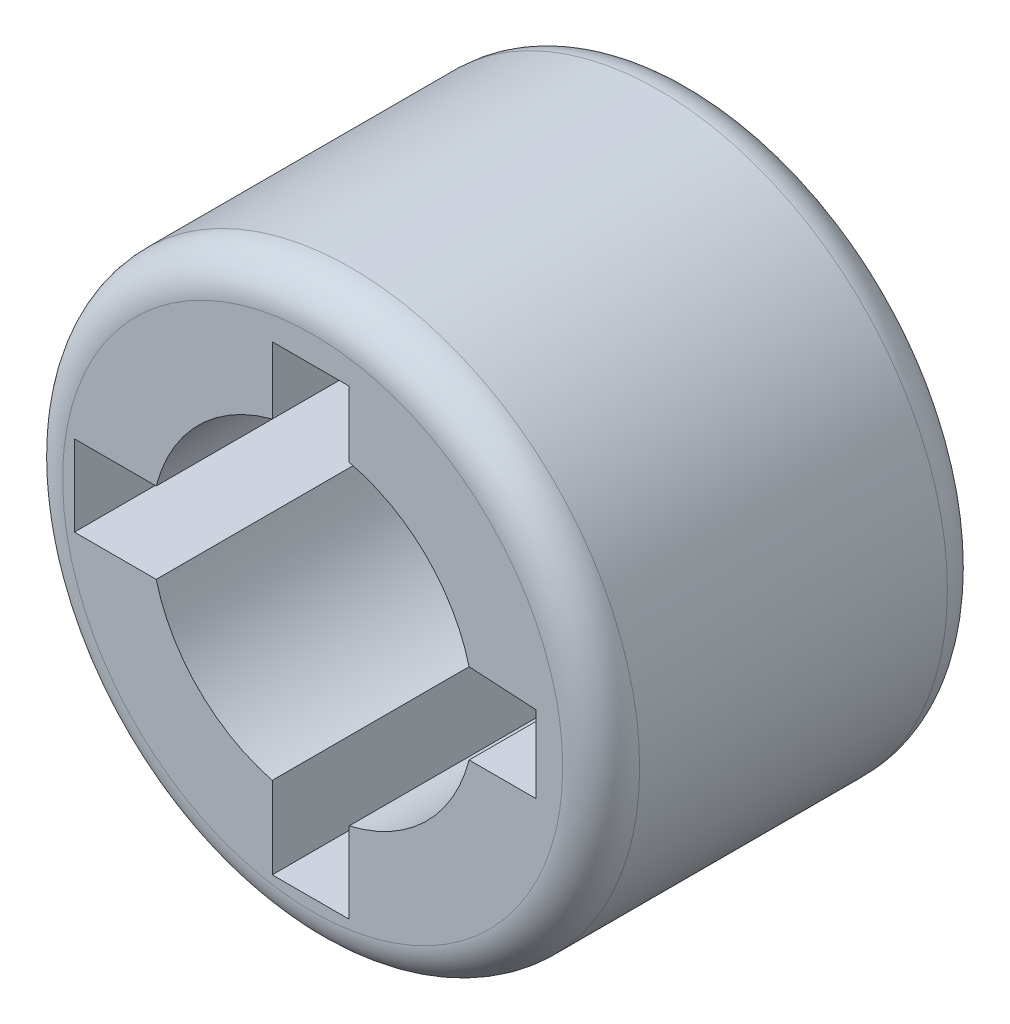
ISO-10303-21;
HEADER;
FILE_DESCRIPTION(('STEP AP214'),'2;1');
FILE_NAME('part.step','',(''),(''),'','','');
FILE_SCHEMA(('AUTOMOTIVE_DESIGN { 1 0 10303 214 1 1 1 1 }'));
ENDSEC;
DATA;
#1=APPLICATION_CONTEXT('core data for automotive mechanical design processes');
#2=APPLICATION_PROTOCOL_DEFINITION('international standard','automotive_design',2000,#1);
#3=PRODUCT_CONTEXT('',#1,'mechanical');
#4=PRODUCT('Part','Part','',(#3));
#5=PRODUCT_RELATED_PRODUCT_CATEGORY('part','',(#4));
#6=PRODUCT_DEFINITION_FORMATION('','',#4);
#7=PRODUCT_DEFINITION_CONTEXT('part definition',#1,'design');
#8=PRODUCT_DEFINITION('design','',#6,#7);
#9=PRODUCT_DEFINITION_SHAPE('','',#8);
#10=(LENGTH_UNIT() NAMED_UNIT(*) SI_UNIT(.MILLI.,.METRE.));
#11=(NAMED_UNIT(*) PLANE_ANGLE_UNIT() SI_UNIT($,.RADIAN.));
#12=(NAMED_UNIT(*) SI_UNIT($,.STERADIAN.) SOLID_ANGLE_UNIT());
#13=UNCERTAINTY_MEASURE_WITH_UNIT(LENGTH_MEASURE(1.E-05),#10,'distance_accuracy_value','');
#14=(GEOMETRIC_REPRESENTATION_CONTEXT(3) GLOBAL_UNCERTAINTY_ASSIGNED_CONTEXT((#13)) GLOBAL_UNIT_ASSIGNED_CONTEXT((#10,
#11,#12)) REPRESENTATION_CONTEXT('',''));
#15=CARTESIAN_POINT('',(0.,0.,0.));
#16=DIRECTION('',(0.,0.,1.));
#17=DIRECTION('',(1.,0.,0.));
#18=AXIS2_PLACEMENT_3D('',#15,#16,#17);
#19=CARTESIAN_POINT('',(0.,0.,10.));
#20=DIRECTION('',(0.,0.,1.));
#21=DIRECTION('',(1.,0.,0.));
#22=AXIS2_PLACEMENT_3D('',#19,#20,#21);
#23=PLANE('',#22);
#24=CARTESIAN_POINT('',(0.,0.,10.));
#25=DIRECTION('',(0.,0.,1.));
#26=DIRECTION('',(1.,0.,0.));
#27=AXIS2_PLACEMENT_3D('',#24,#25,#26);
#28=CIRCLE('',#27,6.5);
#29=CARTESIAN_POINT('',(6.5,0.,10.));
#30=VERTEX_POINT('',#29);
#31=EDGE_CURVE('E11',#30,#30,#28,.T.);
#32=ORIENTED_EDGE('',*,*,#31,.T.);
#33=EDGE_LOOP('',(#32));
#34=FACE_BOUND('',#33,.T.);
#35=CARTESIAN_POINT('',(0.,0.,10.));
#36=DIRECTION('',(0.,0.,1.));
#37=DIRECTION('',(1.,0.,0.));
#38=AXIS2_PLACEMENT_3D('',#35,#36,#37);
#39=CIRCLE('',#38,4.2);
#40=CARTESIAN_POINT('',(4.06663251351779,1.05,10.));
#41=VERTEX_POINT('',#40);
#42=CARTESIAN_POINT('',(0.95,4.09114898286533,10.));
#43=VERTEX_POINT('',#42);
#44=EDGE_CURVE('E154',#41,#43,#39,.T.);
#45=ORIENTED_EDGE('',*,*,#44,.F.);
#46=DIRECTION('',(-0.998352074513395,0.0573858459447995,0.));
#47=VECTOR('',#46,1.);
#48=CARTESIAN_POINT('',(4.06663251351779,1.05,10.));
#49=LINE('',#48,#47);
#50=CARTESIAN_POINT('',(5.80635083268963,0.95,10.));
#51=VERTEX_POINT('',#50);
#52=EDGE_CURVE('E146',#51,#41,#49,.T.);
#53=ORIENTED_EDGE('',*,*,#52,.F.);
#54=DIRECTION('',(0.,1.,0.));
#55=VECTOR('',#54,1.);
#56=CARTESIAN_POINT('',(5.80635083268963,-1.05,10.));
#57=LINE('',#56,#55);
#58=CARTESIAN_POINT('',(5.80635083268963,-1.05,10.));
#59=VERTEX_POINT('',#58);
#60=EDGE_CURVE('E195',#59,#51,#57,.T.);
#61=ORIENTED_EDGE('',*,*,#60,.F.);
#62=DIRECTION('',(1.,0.,0.));
#63=VECTOR('',#62,1.);
#64=CARTESIAN_POINT('',(4.06663251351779,-1.05,10.));
#65=LINE('',#64,#63);
#66=CARTESIAN_POINT('',(4.06663251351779,-1.05,10.));
#67=VERTEX_POINT('',#66);
#68=EDGE_CURVE('E193',#67,#59,#65,.T.);
#69=ORIENTED_EDGE('',*,*,#68,.F.);
#70=CARTESIAN_POINT('',(0.,0.,10.));
#71=DIRECTION('',(0.,0.,1.));
#72=DIRECTION('',(1.,0.,0.));
#73=AXIS2_PLACEMENT_3D('',#70,#71,#72);
#74=CIRCLE('',#73,4.2);
#75=CARTESIAN_POINT('',(0.95,-4.09114898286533,10.));
#76=VERTEX_POINT('',#75);
#77=EDGE_CURVE('E191',#76,#67,#74,.T.);
#78=ORIENTED_EDGE('',*,*,#77,.F.);
#79=DIRECTION('',(0.,1.,0.));
#80=VECTOR('',#79,1.);
#81=CARTESIAN_POINT('',(0.95,-6.19364916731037,10.));
#82=LINE('',#81,#80);
#83=CARTESIAN_POINT('',(0.95,-6.19364916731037,10.));
#84=VERTEX_POINT('',#83);
#85=EDGE_CURVE('E189',#84,#76,#82,.T.);
#86=ORIENTED_EDGE('',*,*,#85,.F.);
#87=DIRECTION('',(1.,0.,0.));
#88=VECTOR('',#87,1.);
#89=CARTESIAN_POINT('',(-1.05,-6.19364916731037,10.));
#90=LINE('',#89,#88);
#91=CARTESIAN_POINT('',(-1.05,-6.19364916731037,10.));
#92=VERTEX_POINT('',#91);
#93=EDGE_CURVE('E187',#92,#84,#90,.T.);
#94=ORIENTED_EDGE('',*,*,#93,.F.);
#95=DIRECTION('',(0.,-1.,0.));
#96=VECTOR('',#95,1.);
#97=CARTESIAN_POINT('',(-1.05,-6.19364916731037,10.));
#98=LINE('',#97,#96);
#99=CARTESIAN_POINT('',(-1.05,-4.06663251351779,10.));
#100=VERTEX_POINT('',#99);
#101=EDGE_CURVE('E185',#100,#92,#98,.T.);
#102=ORIENTED_EDGE('',*,*,#101,.F.);
#103=CARTESIAN_POINT('',(0.,0.,10.));
#104=DIRECTION('',(0.,0.,1.));
#105=DIRECTION('',(1.,0.,0.));
#106=AXIS2_PLACEMENT_3D('',#103,#104,#105);
#107=CIRCLE('',#106,4.2);
#108=CARTESIAN_POINT('',(-4.06663251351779,-1.05,10.));
#109=VERTEX_POINT('',#108);
#110=EDGE_CURVE('E183',#109,#100,#107,.T.);
#111=ORIENTED_EDGE('',*,*,#110,.F.);
#112=DIRECTION('',(1.,0.,0.));
#113=VECTOR('',#112,1.);
#114=CARTESIAN_POINT('',(-6.19323249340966,-1.05,10.));
#115=LINE('',#114,#113);
#116=CARTESIAN_POINT('',(-6.19323249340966,-1.05,10.));
#117=VERTEX_POINT('',#116);
#118=EDGE_CURVE('E181',#117,#109,#115,.T.);
#119=ORIENTED_EDGE('',*,*,#118,.F.);
#120=DIRECTION('',(0.,-1.,0.));
#121=VECTOR('',#120,1.);
#122=CARTESIAN_POINT('',(-6.19323249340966,-1.05,10.));
#123=LINE('',#122,#121);
#124=CARTESIAN_POINT('',(-6.19323249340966,1.05,10.));
#125=VERTEX_POINT('',#124);
#126=EDGE_CURVE('E179',#125,#117,#123,.T.);
#127=ORIENTED_EDGE('',*,*,#126,.F.);
#128=DIRECTION('',(-1.,0.,0.));
#129=VECTOR('',#128,1.);
#130=CARTESIAN_POINT('',(-6.19323249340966,1.05,10.));
#131=LINE('',#130,#129);
#132=CARTESIAN_POINT('',(-4.06663251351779,1.05,10.));
#133=VERTEX_POINT('',#132);
#134=EDGE_CURVE('E177',#133,#125,#131,.T.);
#135=ORIENTED_EDGE('',*,*,#134,.F.);
#136=CARTESIAN_POINT('',(0.,0.,10.));
#137=DIRECTION('',(0.,0.,1.));
#138=DIRECTION('',(1.,0.,0.));
#139=AXIS2_PLACEMENT_3D('',#136,#137,#138);
#140=CIRCLE('',#139,4.2);
#141=CARTESIAN_POINT('',(-1.05,4.06663251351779,10.));
#142=VERTEX_POINT('',#141);
#143=EDGE_CURVE('E175',#142,#133,#140,.T.);
#144=ORIENTED_EDGE('',*,*,#143,.F.);
#145=DIRECTION('',(0.,-1.,0.));
#146=VECTOR('',#145,1.);
#147=CARTESIAN_POINT('',(-1.05,4.06663251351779,10.));
#148=LINE('',#147,#146);
#149=CARTESIAN_POINT('',(-1.05,5.80635083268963,10.));
#150=VERTEX_POINT('',#149);
#151=EDGE_CURVE('E173',#150,#142,#148,.T.);
#152=ORIENTED_EDGE('',*,*,#151,.F.);
#153=DIRECTION('',(-1.,0.,0.));
#154=VECTOR('',#153,1.);
#155=CARTESIAN_POINT('',(-1.05,5.80635083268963,10.));
#156=LINE('',#155,#154);
#157=CARTESIAN_POINT('',(0.95,5.80635083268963,10.));
#158=VERTEX_POINT('',#157);
#159=EDGE_CURVE('E169',#158,#150,#156,.T.);
#160=ORIENTED_EDGE('',*,*,#159,.F.);
#161=DIRECTION('',(0.,1.,0.));
#162=VECTOR('',#161,1.);
#163=CARTESIAN_POINT('',(0.95,4.09114898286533,10.));
#164=LINE('',#163,#162);
#165=EDGE_CURVE('E167',#43,#158,#164,.T.);
#166=ORIENTED_EDGE('',*,*,#165,.F.);
#167=EDGE_LOOP('',(#45,#53,#61,#69,#78,#86,#94,#102,#111,#119,#127,#135,#144,#152,#160,#166));
#168=FACE_BOUND('',#167,.T.);
#169=ADVANCED_FACE('F33',(#34,#168),#23,.T.);
#170=CARTESIAN_POINT('',(0.,0.,0.));
#171=DIRECTION('',(0.,0.,1.));
#172=DIRECTION('',(1.,0.,0.));
#173=AXIS2_PLACEMENT_3D('',#170,#171,#172);
#174=PLANE('',#173);
#175=CARTESIAN_POINT('',(0.,0.,0.));
#176=DIRECTION('',(0.,0.,1.));
#177=DIRECTION('',(1.,0.,0.));
#178=AXIS2_PLACEMENT_3D('',#175,#176,#177);
#179=CIRCLE('',#178,6.5);
#180=CARTESIAN_POINT('',(6.5,0.,0.));
#181=VERTEX_POINT('',#180);
#182=EDGE_CURVE('E41',#181,#181,#179,.F.);
#183=ORIENTED_EDGE('',*,*,#182,.T.);
#184=EDGE_LOOP('',(#183));
#185=FACE_BOUND('',#184,.T.);
#186=DIRECTION('',(-0.998352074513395,0.0573858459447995,0.));
#187=VECTOR('',#186,1.);
#188=CARTESIAN_POINT('',(4.06663251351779,1.05,0.));
#189=LINE('',#188,#187);
#190=CARTESIAN_POINT('',(5.80635083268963,0.95,0.));
#191=VERTEX_POINT('',#190);
#192=CARTESIAN_POINT('',(4.06663251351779,1.05,0.));
#193=VERTEX_POINT('',#192);
#194=EDGE_CURVE('E56',#191,#193,#189,.T.);
#195=ORIENTED_EDGE('',*,*,#194,.T.);
#196=CARTESIAN_POINT('',(0.,0.,0.));
#197=DIRECTION('',(0.,0.,1.));
#198=DIRECTION('',(1.,0.,0.));
#199=AXIS2_PLACEMENT_3D('',#196,#197,#198);
#200=CIRCLE('',#199,4.2);
#201=CARTESIAN_POINT('',(0.95,4.09114898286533,0.));
#202=VERTEX_POINT('',#201);
#203=EDGE_CURVE('E161',#193,#202,#200,.T.);
#204=ORIENTED_EDGE('',*,*,#203,.T.);
#205=DIRECTION('',(0.,1.,0.));
#206=VECTOR('',#205,1.);
#207=CARTESIAN_POINT('',(0.95,4.09114898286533,0.));
#208=LINE('',#207,#206);
#209=CARTESIAN_POINT('',(0.95,5.80635083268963,0.));
#210=VERTEX_POINT('',#209);
#211=EDGE_CURVE('E199',#202,#210,#208,.T.);
#212=ORIENTED_EDGE('',*,*,#211,.T.);
#213=DIRECTION('',(-1.,0.,0.));
#214=VECTOR('',#213,1.);
#215=CARTESIAN_POINT('',(-1.05,5.80635083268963,0.));
#216=LINE('',#215,#214);
#217=CARTESIAN_POINT('',(-1.05,5.80635083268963,0.));
#218=VERTEX_POINT('',#217);
#219=EDGE_CURVE('E202',#210,#218,#216,.T.);
#220=ORIENTED_EDGE('',*,*,#219,.T.);
#221=DIRECTION('',(0.,-1.,0.));
#222=VECTOR('',#221,1.);
#223=CARTESIAN_POINT('',(-1.05,4.06663251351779,0.));
#224=LINE('',#223,#222);
#225=CARTESIAN_POINT('',(-1.05,4.06663251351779,0.));
#226=VERTEX_POINT('',#225);
#227=EDGE_CURVE('E205',#218,#226,#224,.T.);
#228=ORIENTED_EDGE('',*,*,#227,.T.);
#229=CARTESIAN_POINT('',(0.,0.,0.));
#230=DIRECTION('',(0.,0.,1.));
#231=DIRECTION('',(1.,0.,0.));
#232=AXIS2_PLACEMENT_3D('',#229,#230,#231);
#233=CIRCLE('',#232,4.2);
#234=CARTESIAN_POINT('',(-4.06663251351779,1.05,0.));
#235=VERTEX_POINT('',#234);
#236=EDGE_CURVE('E208',#226,#235,#233,.T.);
#237=ORIENTED_EDGE('',*,*,#236,.T.);
#238=DIRECTION('',(-1.,0.,0.));
#239=VECTOR('',#238,1.);
#240=CARTESIAN_POINT('',(-6.19323249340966,1.05,0.));
#241=LINE('',#240,#239);
#242=CARTESIAN_POINT('',(-6.19323249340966,1.05,0.));
#243=VERTEX_POINT('',#242);
#244=EDGE_CURVE('E211',#235,#243,#241,.T.);
#245=ORIENTED_EDGE('',*,*,#244,.T.);
#246=DIRECTION('',(0.,-1.,0.));
#247=VECTOR('',#246,1.);
#248=CARTESIAN_POINT('',(-6.19323249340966,-1.05,0.));
#249=LINE('',#248,#247);
#250=CARTESIAN_POINT('',(-6.19323249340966,-1.05,0.));
#251=VERTEX_POINT('',#250);
#252=EDGE_CURVE('E214',#243,#251,#249,.T.);
#253=ORIENTED_EDGE('',*,*,#252,.T.);
#254=DIRECTION('',(1.,0.,0.));
#255=VECTOR('',#254,1.);
#256=CARTESIAN_POINT('',(-6.19323249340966,-1.05,0.));
#257=LINE('',#256,#255);
#258=CARTESIAN_POINT('',(-4.06663251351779,-1.05,0.));
#259=VERTEX_POINT('',#258);
#260=EDGE_CURVE('E217',#251,#259,#257,.T.);
#261=ORIENTED_EDGE('',*,*,#260,.T.);
#262=CARTESIAN_POINT('',(0.,0.,0.));
#263=DIRECTION('',(0.,0.,1.));
#264=DIRECTION('',(1.,0.,0.));
#265=AXIS2_PLACEMENT_3D('',#262,#263,#264);
#266=CIRCLE('',#265,4.2);
#267=CARTESIAN_POINT('',(-1.05,-4.06663251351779,0.));
#268=VERTEX_POINT('',#267);
#269=EDGE_CURVE('E220',#259,#268,#266,.T.);
#270=ORIENTED_EDGE('',*,*,#269,.T.);
#271=DIRECTION('',(0.,-1.,0.));
#272=VECTOR('',#271,1.);
#273=CARTESIAN_POINT('',(-1.05,-6.19364916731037,0.));
#274=LINE('',#273,#272);
#275=CARTESIAN_POINT('',(-1.05,-6.19364916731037,0.));
#276=VERTEX_POINT('',#275);
#277=EDGE_CURVE('E223',#268,#276,#274,.T.);
#278=ORIENTED_EDGE('',*,*,#277,.T.);
#279=DIRECTION('',(1.,0.,0.));
#280=VECTOR('',#279,1.);
#281=CARTESIAN_POINT('',(-1.05,-6.19364916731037,0.));
#282=LINE('',#281,#280);
#283=CARTESIAN_POINT('',(0.95,-6.19364916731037,0.));
#284=VERTEX_POINT('',#283);
#285=EDGE_CURVE('E226',#276,#284,#282,.T.);
#286=ORIENTED_EDGE('',*,*,#285,.T.);
#287=DIRECTION('',(0.,1.,0.));
#288=VECTOR('',#287,1.);
#289=CARTESIAN_POINT('',(0.95,-6.19364916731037,0.));
#290=LINE('',#289,#288);
#291=CARTESIAN_POINT('',(0.95,-4.09114898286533,0.));
#292=VERTEX_POINT('',#291);
#293=EDGE_CURVE('E229',#284,#292,#290,.T.);
#294=ORIENTED_EDGE('',*,*,#293,.T.);
#295=CARTESIAN_POINT('',(0.,0.,0.));
#296=DIRECTION('',(0.,0.,1.));
#297=DIRECTION('',(1.,0.,0.));
#298=AXIS2_PLACEMENT_3D('',#295,#296,#297);
#299=CIRCLE('',#298,4.2);
#300=CARTESIAN_POINT('',(4.06663251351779,-1.05,0.));
#301=VERTEX_POINT('',#300);
#302=EDGE_CURVE('E232',#292,#301,#299,.T.);
#303=ORIENTED_EDGE('',*,*,#302,.T.);
#304=DIRECTION('',(1.,0.,0.));
#305=VECTOR('',#304,1.);
#306=CARTESIAN_POINT('',(4.06663251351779,-1.05,0.));
#307=LINE('',#306,#305);
#308=CARTESIAN_POINT('',(5.80635083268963,-1.05,0.));
#309=VERTEX_POINT('',#308);
#310=EDGE_CURVE('E235',#301,#309,#307,.T.);
#311=ORIENTED_EDGE('',*,*,#310,.T.);
#312=DIRECTION('',(0.,1.,0.));
#313=VECTOR('',#312,1.);
#314=CARTESIAN_POINT('',(5.80635083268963,-1.05,0.));
#315=LINE('',#314,#313);
#316=EDGE_CURVE('E155',#309,#191,#315,.T.);
#317=ORIENTED_EDGE('',*,*,#316,.T.);
#318=EDGE_LOOP('',(#195,#204,#212,#220,#228,#237,#245,#253,#261,#270,#278,#286,#294,#303,#311,#317));
#319=FACE_BOUND('',#318,.T.);
#320=ADVANCED_FACE('F274',(#185,#319),#174,.F.);
#321=CARTESIAN_POINT('',(0.,0.,10.));
#322=DIRECTION('',(0.,0.,-1.));
#323=DIRECTION('',(-1.,0.,0.));
#324=AXIS2_PLACEMENT_3D('',#321,#322,#323);
#325=CYLINDRICAL_SURFACE('',#324,7.5);
#326=CARTESIAN_POINT('',(0.,0.,0.999999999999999));
#327=DIRECTION('',(0.,0.,1.));
#328=DIRECTION('',(1.,0.,0.));
#329=AXIS2_PLACEMENT_3D('',#326,#327,#328);
#330=CIRCLE('',#329,7.5);
#331=CARTESIAN_POINT('',(7.5,0.,0.999999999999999));
#332=VERTEX_POINT('',#331);
#333=EDGE_CURVE('E269',#332,#332,#330,.T.);
#334=ORIENTED_EDGE('',*,*,#333,.T.);
#335=EDGE_LOOP('',(#334));
#336=FACE_BOUND('',#335,.T.);
#337=CARTESIAN_POINT('',(0.,0.,9.));
#338=DIRECTION('',(0.,0.,1.));
#339=DIRECTION('',(1.,0.,0.));
#340=AXIS2_PLACEMENT_3D('',#337,#338,#339);
#341=CIRCLE('',#340,7.5);
#342=CARTESIAN_POINT('',(7.5,0.,9.));
#343=VERTEX_POINT('',#342);
#344=EDGE_CURVE('E162',#343,#343,#341,.F.);
#345=ORIENTED_EDGE('',*,*,#344,.T.);
#346=EDGE_LOOP('',(#345));
#347=FACE_BOUND('',#346,.T.);
#348=ADVANCED_FACE('F283',(#336,#347),#325,.T.);
#349=CARTESIAN_POINT('',(4.06663251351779,1.05,10.));
#350=DIRECTION('',(-0.0573858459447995,-0.998352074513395,0.));
#351=DIRECTION('',(0.998352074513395,-0.0573858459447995,0.));
#352=AXIS2_PLACEMENT_3D('',#349,#350,#351);
#353=PLANE('',#352);
#354=ORIENTED_EDGE('',*,*,#194,.F.);
#355=DIRECTION('',(0.,0.,-1.));
#356=VECTOR('',#355,1.);
#357=CARTESIAN_POINT('',(5.80635083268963,0.95,10.));
#358=LINE('',#357,#356);
#359=EDGE_CURVE('E150',#51,#191,#358,.T.);
#360=ORIENTED_EDGE('',*,*,#359,.F.);
#361=ORIENTED_EDGE('',*,*,#52,.T.);
#362=DIRECTION('',(0.,0.,-1.));
#363=VECTOR('',#362,1.);
#364=CARTESIAN_POINT('',(4.06663251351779,1.05,10.));
#365=LINE('',#364,#363);
#366=EDGE_CURVE('E149',#41,#193,#365,.T.);
#367=ORIENTED_EDGE('',*,*,#366,.T.);
#368=EDGE_LOOP('',(#354,#360,#361,#367));
#369=FACE_BOUND('',#368,.T.);
#370=ADVANCED_FACE('F148',(#369),#353,.T.);
#371=CARTESIAN_POINT('',(0.,0.,10.));
#372=DIRECTION('',(0.,0.,-1.));
#373=DIRECTION('',(-1.,0.,0.));
#374=AXIS2_PLACEMENT_3D('',#371,#372,#373);
#375=CYLINDRICAL_SURFACE('',#374,4.2);
#376=ORIENTED_EDGE('',*,*,#203,.F.);
#377=ORIENTED_EDGE('',*,*,#366,.F.);
#378=ORIENTED_EDGE('',*,*,#44,.T.);
#379=DIRECTION('',(0.,0.,-1.));
#380=VECTOR('',#379,1.);
#381=CARTESIAN_POINT('',(0.95,4.09114898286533,10.));
#382=LINE('',#381,#380);
#383=EDGE_CURVE('E163',#43,#202,#382,.T.);
#384=ORIENTED_EDGE('',*,*,#383,.T.);
#385=EDGE_LOOP('',(#376,#377,#378,#384));
#386=FACE_BOUND('',#385,.T.);
#387=ADVANCED_FACE('F158',(#386),#375,.F.);
#388=CARTESIAN_POINT('',(0.95,4.09114898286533,10.));
#389=DIRECTION('',(-1.,0.,0.));
#390=DIRECTION('',(0.,0.,1.));
#391=AXIS2_PLACEMENT_3D('',#388,#389,#390);
#392=PLANE('',#391);
#393=ORIENTED_EDGE('',*,*,#211,.F.);
#394=ORIENTED_EDGE('',*,*,#383,.F.);
#395=ORIENTED_EDGE('',*,*,#165,.T.);
#396=DIRECTION('',(0.,0.,-1.));
#397=VECTOR('',#396,1.);
#398=CARTESIAN_POINT('',(0.95,5.80635083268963,10.));
#399=LINE('',#398,#397);
#400=EDGE_CURVE('E264',#158,#210,#399,.T.);
#401=ORIENTED_EDGE('',*,*,#400,.T.);
#402=EDGE_LOOP('',(#393,#394,#395,#401));
#403=FACE_BOUND('',#402,.T.);
#404=ADVANCED_FACE('F304',(#403),#392,.T.);
#405=CARTESIAN_POINT('',(-1.05,5.80635083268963,10.));
#406=DIRECTION('',(0.,-1.,0.));
#407=DIRECTION('',(0.,0.,-1.));
#408=AXIS2_PLACEMENT_3D('',#405,#406,#407);
#409=PLANE('',#408);
#410=ORIENTED_EDGE('',*,*,#219,.F.);
#411=ORIENTED_EDGE('',*,*,#400,.F.);
#412=ORIENTED_EDGE('',*,*,#159,.T.);
#413=DIRECTION('',(0.,0.,-1.));
#414=VECTOR('',#413,1.);
#415=CARTESIAN_POINT('',(-1.05,5.80635083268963,10.));
#416=LINE('',#415,#414);
#417=EDGE_CURVE('E262',#150,#218,#416,.T.);
#418=ORIENTED_EDGE('',*,*,#417,.T.);
#419=EDGE_LOOP('',(#410,#411,#412,#418));
#420=FACE_BOUND('',#419,.T.);
#421=ADVANCED_FACE('F307',(#420),#409,.T.);
#422=CARTESIAN_POINT('',(-1.05,4.06663251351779,10.));
#423=DIRECTION('',(1.,0.,0.));
#424=DIRECTION('',(0.,0.,-1.));
#425=AXIS2_PLACEMENT_3D('',#422,#423,#424);
#426=PLANE('',#425);
#427=ORIENTED_EDGE('',*,*,#227,.F.);
#428=ORIENTED_EDGE('',*,*,#417,.F.);
#429=ORIENTED_EDGE('',*,*,#151,.T.);
#430=DIRECTION('',(0.,0.,-1.));
#431=VECTOR('',#430,1.);
#432=CARTESIAN_POINT('',(-1.05,4.06663251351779,10.));
#433=LINE('',#432,#431);
#434=EDGE_CURVE('E260',#142,#226,#433,.T.);
#435=ORIENTED_EDGE('',*,*,#434,.T.);
#436=EDGE_LOOP('',(#427,#428,#429,#435));
#437=FACE_BOUND('',#436,.T.);
#438=ADVANCED_FACE('F311',(#437),#426,.T.);
#439=CARTESIAN_POINT('',(0.,0.,10.));
#440=DIRECTION('',(0.,0.,-1.));
#441=DIRECTION('',(-1.,0.,0.));
#442=AXIS2_PLACEMENT_3D('',#439,#440,#441);
#443=CYLINDRICAL_SURFACE('',#442,4.2);
#444=ORIENTED_EDGE('',*,*,#236,.F.);
#445=ORIENTED_EDGE('',*,*,#434,.F.);
#446=ORIENTED_EDGE('',*,*,#143,.T.);
#447=DIRECTION('',(0.,0.,-1.));
#448=VECTOR('',#447,1.);
#449=CARTESIAN_POINT('',(-4.06663251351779,1.05,10.));
#450=LINE('',#449,#448);
#451=EDGE_CURVE('E258',#133,#235,#450,.T.);
#452=ORIENTED_EDGE('',*,*,#451,.T.);
#453=EDGE_LOOP('',(#444,#445,#446,#452));
#454=FACE_BOUND('',#453,.T.);
#455=ADVANCED_FACE('F315',(#454),#443,.F.);
#456=CARTESIAN_POINT('',(-6.19323249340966,1.05,10.));
#457=DIRECTION('',(0.,-1.,0.));
#458=DIRECTION('',(1.,0.,0.));
#459=AXIS2_PLACEMENT_3D('',#456,#457,#458);
#460=PLANE('',#459);
#461=ORIENTED_EDGE('',*,*,#244,.F.);
#462=ORIENTED_EDGE('',*,*,#451,.F.);
#463=ORIENTED_EDGE('',*,*,#134,.T.);
#464=DIRECTION('',(0.,0.,-1.));
#465=VECTOR('',#464,1.);
#466=CARTESIAN_POINT('',(-6.19323249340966,1.05,10.));
#467=LINE('',#466,#465);
#468=EDGE_CURVE('E256',#125,#243,#467,.T.);
#469=ORIENTED_EDGE('',*,*,#468,.T.);
#470=EDGE_LOOP('',(#461,#462,#463,#469));
#471=FACE_BOUND('',#470,.T.);
#472=ADVANCED_FACE('F319',(#471),#460,.T.);
#473=CARTESIAN_POINT('',(-6.19323249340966,-1.05,10.));
#474=DIRECTION('',(1.,0.,0.));
#475=DIRECTION('',(0.,0.,-1.));
#476=AXIS2_PLACEMENT_3D('',#473,#474,#475);
#477=PLANE('',#476);
#478=ORIENTED_EDGE('',*,*,#252,.F.);
#479=ORIENTED_EDGE('',*,*,#468,.F.);
#480=ORIENTED_EDGE('',*,*,#126,.T.);
#481=DIRECTION('',(0.,0.,-1.));
#482=VECTOR('',#481,1.);
#483=CARTESIAN_POINT('',(-6.19323249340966,-1.05,10.));
#484=LINE('',#483,#482);
#485=EDGE_CURVE('E254',#117,#251,#484,.T.);
#486=ORIENTED_EDGE('',*,*,#485,.T.);
#487=EDGE_LOOP('',(#478,#479,#480,#486));
#488=FACE_BOUND('',#487,.T.);
#489=ADVANCED_FACE('F323',(#488),#477,.T.);
#490=CARTESIAN_POINT('',(-6.19323249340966,-1.05,10.));
#491=DIRECTION('',(0.,1.,0.));
#492=DIRECTION('',(0.,0.,1.));
#493=AXIS2_PLACEMENT_3D('',#490,#491,#492);
#494=PLANE('',#493);
#495=ORIENTED_EDGE('',*,*,#260,.F.);
#496=ORIENTED_EDGE('',*,*,#485,.F.);
#497=ORIENTED_EDGE('',*,*,#118,.T.);
#498=DIRECTION('',(0.,0.,-1.));
#499=VECTOR('',#498,1.);
#500=CARTESIAN_POINT('',(-4.06663251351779,-1.05,10.));
#501=LINE('',#500,#499);
#502=EDGE_CURVE('E252',#109,#259,#501,.T.);
#503=ORIENTED_EDGE('',*,*,#502,.T.);
#504=EDGE_LOOP('',(#495,#496,#497,#503));
#505=FACE_BOUND('',#504,.T.);
#506=ADVANCED_FACE('F327',(#505),#494,.T.);
#507=CARTESIAN_POINT('',(0.,0.,10.));
#508=DIRECTION('',(0.,0.,-1.));
#509=DIRECTION('',(-1.,0.,0.));
#510=AXIS2_PLACEMENT_3D('',#507,#508,#509);
#511=CYLINDRICAL_SURFACE('',#510,4.2);
#512=ORIENTED_EDGE('',*,*,#269,.F.);
#513=ORIENTED_EDGE('',*,*,#502,.F.);
#514=ORIENTED_EDGE('',*,*,#110,.T.);
#515=DIRECTION('',(0.,0.,-1.));
#516=VECTOR('',#515,1.);
#517=CARTESIAN_POINT('',(-1.05,-4.06663251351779,10.));
#518=LINE('',#517,#516);
#519=EDGE_CURVE('E250',#100,#268,#518,.T.);
#520=ORIENTED_EDGE('',*,*,#519,.T.);
#521=EDGE_LOOP('',(#512,#513,#514,#520));
#522=FACE_BOUND('',#521,.T.);
#523=ADVANCED_FACE('F331',(#522),#511,.F.);
#524=CARTESIAN_POINT('',(-1.05,-6.19364916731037,10.));
#525=DIRECTION('',(1.,0.,0.));
#526=DIRECTION('',(0.,0.,-1.));
#527=AXIS2_PLACEMENT_3D('',#524,#525,#526);
#528=PLANE('',#527);
#529=ORIENTED_EDGE('',*,*,#277,.F.);
#530=ORIENTED_EDGE('',*,*,#519,.F.);
#531=ORIENTED_EDGE('',*,*,#101,.T.);
#532=DIRECTION('',(0.,0.,-1.));
#533=VECTOR('',#532,1.);
#534=CARTESIAN_POINT('',(-1.05,-6.19364916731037,10.));
#535=LINE('',#534,#533);
#536=EDGE_CURVE('E248',#92,#276,#535,.T.);
#537=ORIENTED_EDGE('',*,*,#536,.T.);
#538=EDGE_LOOP('',(#529,#530,#531,#537));
#539=FACE_BOUND('',#538,.T.);
#540=ADVANCED_FACE('F335',(#539),#528,.T.);
#541=CARTESIAN_POINT('',(-1.05,-6.19364916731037,10.));
#542=DIRECTION('',(0.,1.,0.));
#543=DIRECTION('',(0.,0.,1.));
#544=AXIS2_PLACEMENT_3D('',#541,#542,#543);
#545=PLANE('',#544);
#546=ORIENTED_EDGE('',*,*,#285,.F.);
#547=ORIENTED_EDGE('',*,*,#536,.F.);
#548=ORIENTED_EDGE('',*,*,#93,.T.);
#549=DIRECTION('',(0.,0.,-1.));
#550=VECTOR('',#549,1.);
#551=CARTESIAN_POINT('',(0.95,-6.19364916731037,10.));
#552=LINE('',#551,#550);
#553=EDGE_CURVE('E246',#84,#284,#552,.T.);
#554=ORIENTED_EDGE('',*,*,#553,.T.);
#555=EDGE_LOOP('',(#546,#547,#548,#554));
#556=FACE_BOUND('',#555,.T.);
#557=ADVANCED_FACE('F339',(#556),#545,.T.);
#558=CARTESIAN_POINT('',(0.95,-6.19364916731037,10.));
#559=DIRECTION('',(-1.,0.,0.));
#560=DIRECTION('',(0.,0.,1.));
#561=AXIS2_PLACEMENT_3D('',#558,#559,#560);
#562=PLANE('',#561);
#563=ORIENTED_EDGE('',*,*,#293,.F.);
#564=ORIENTED_EDGE('',*,*,#553,.F.);
#565=ORIENTED_EDGE('',*,*,#85,.T.);
#566=DIRECTION('',(0.,0.,-1.));
#567=VECTOR('',#566,1.);
#568=CARTESIAN_POINT('',(0.95,-4.09114898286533,10.));
#569=LINE('',#568,#567);
#570=EDGE_CURVE('E244',#76,#292,#569,.T.);
#571=ORIENTED_EDGE('',*,*,#570,.T.);
#572=EDGE_LOOP('',(#563,#564,#565,#571));
#573=FACE_BOUND('',#572,.T.);
#574=ADVANCED_FACE('F343',(#573),#562,.T.);
#575=CARTESIAN_POINT('',(0.,0.,10.));
#576=DIRECTION('',(0.,0.,-1.));
#577=DIRECTION('',(-1.,0.,0.));
#578=AXIS2_PLACEMENT_3D('',#575,#576,#577);
#579=CYLINDRICAL_SURFACE('',#578,4.2);
#580=ORIENTED_EDGE('',*,*,#302,.F.);
#581=ORIENTED_EDGE('',*,*,#570,.F.);
#582=ORIENTED_EDGE('',*,*,#77,.T.);
#583=DIRECTION('',(0.,0.,-1.));
#584=VECTOR('',#583,1.);
#585=CARTESIAN_POINT('',(4.06663251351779,-1.05,10.));
#586=LINE('',#585,#584);
#587=EDGE_CURVE('E242',#67,#301,#586,.T.);
#588=ORIENTED_EDGE('',*,*,#587,.T.);
#589=EDGE_LOOP('',(#580,#581,#582,#588));
#590=FACE_BOUND('',#589,.T.);
#591=ADVANCED_FACE('F347',(#590),#579,.F.);
#592=CARTESIAN_POINT('',(4.06663251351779,-1.05,10.));
#593=DIRECTION('',(0.,1.,0.));
#594=DIRECTION('',(0.,0.,1.));
#595=AXIS2_PLACEMENT_3D('',#592,#593,#594);
#596=PLANE('',#595);
#597=ORIENTED_EDGE('',*,*,#310,.F.);
#598=ORIENTED_EDGE('',*,*,#587,.F.);
#599=ORIENTED_EDGE('',*,*,#68,.T.);
#600=DIRECTION('',(0.,0.,-1.));
#601=VECTOR('',#600,1.);
#602=CARTESIAN_POINT('',(5.80635083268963,-1.05,10.));
#603=LINE('',#602,#601);
#604=EDGE_CURVE('E48',#59,#309,#603,.T.);
#605=ORIENTED_EDGE('',*,*,#604,.T.);
#606=EDGE_LOOP('',(#597,#598,#599,#605));
#607=FACE_BOUND('',#606,.T.);
#608=ADVANCED_FACE('F351',(#607),#596,.T.);
#609=CARTESIAN_POINT('',(5.80635083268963,-1.05,10.));
#610=DIRECTION('',(-1.,0.,0.));
#611=DIRECTION('',(0.,0.,1.));
#612=AXIS2_PLACEMENT_3D('',#609,#610,#611);
#613=PLANE('',#612);
#614=ORIENTED_EDGE('',*,*,#316,.F.);
#615=ORIENTED_EDGE('',*,*,#604,.F.);
#616=ORIENTED_EDGE('',*,*,#60,.T.);
#617=ORIENTED_EDGE('',*,*,#359,.T.);
#618=EDGE_LOOP('',(#614,#615,#616,#617));
#619=FACE_BOUND('',#618,.T.);
#620=ADVANCED_FACE('F280',(#619),#613,.T.);
#621=CARTESIAN_POINT('',(0.,0.,0.999999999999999));
#622=DIRECTION('',(0.,0.,1.));
#623=DIRECTION('',(1.,0.,0.));
#624=AXIS2_PLACEMENT_3D('',#621,#622,#623);
#625=TOROIDAL_SURFACE('',#624,6.5,1.);
#626=ORIENTED_EDGE('',*,*,#182,.F.);
#627=EDGE_LOOP('',(#626));
#628=FACE_BOUND('',#627,.T.);
#629=ORIENTED_EDGE('',*,*,#333,.F.);
#630=EDGE_LOOP('',(#629));
#631=FACE_BOUND('',#630,.T.);
#632=ADVANCED_FACE('F277',(#628,#631),#625,.T.);
#633=CARTESIAN_POINT('',(0.,0.,9.));
#634=DIRECTION('',(0.,0.,1.));
#635=DIRECTION('',(1.,0.,0.));
#636=AXIS2_PLACEMENT_3D('',#633,#634,#635);
#637=TOROIDAL_SURFACE('',#636,6.5,1.);
#638=ORIENTED_EDGE('',*,*,#344,.F.);
#639=EDGE_LOOP('',(#638));
#640=FACE_BOUND('',#639,.T.);
#641=ORIENTED_EDGE('',*,*,#31,.F.);
#642=EDGE_LOOP('',(#641));
#643=FACE_BOUND('',#642,.T.);
#644=ADVANCED_FACE('F35',(#640,#643),#637,.T.);
#645=CLOSED_SHELL('',(#169,#320,#348,#370,#387,#404,#421,#438,#455,#472,#489,#506,#523,#540,
#557,#574,#591,#608,#620,#632,#644));
#646=MANIFOLD_SOLID_BREP('B2',#645);
#647=ADVANCED_BREP_SHAPE_REPRESENTATION('',(#18,#646),#14);
#648=SHAPE_DEFINITION_REPRESENTATION(#9,#647);
ENDSEC;
END-ISO-10303-21;
